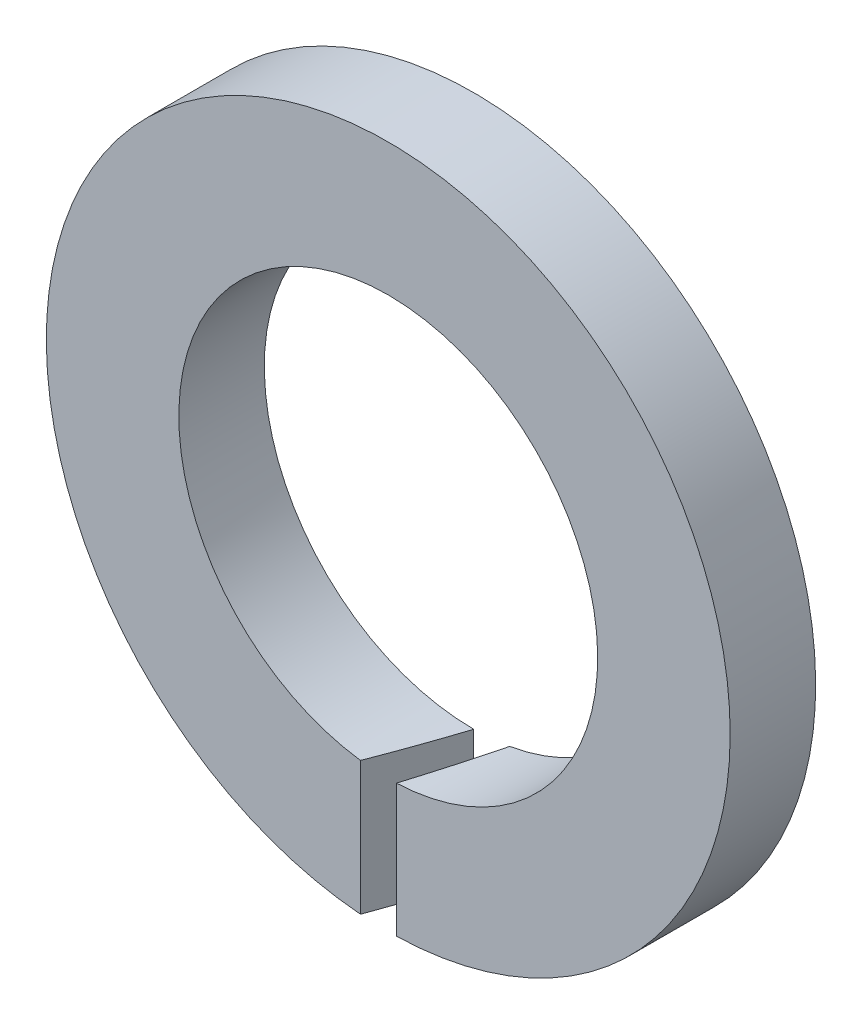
ISO-10303-21;
HEADER;
FILE_DESCRIPTION(('STEP AP214'),'2;1');
FILE_NAME('part.step','',(''),(''),'','','');
FILE_SCHEMA(('AUTOMOTIVE_DESIGN { 1 0 10303 214 1 1 1 1 }'));
ENDSEC;
DATA;
#1=APPLICATION_CONTEXT('core data for automotive mechanical design processes');
#2=APPLICATION_PROTOCOL_DEFINITION('international standard','automotive_design',2000,#1);
#3=PRODUCT_CONTEXT('',#1,'mechanical');
#4=PRODUCT('Part','Part','',(#3));
#5=PRODUCT_RELATED_PRODUCT_CATEGORY('part','',(#4));
#6=PRODUCT_DEFINITION_FORMATION('','',#4);
#7=PRODUCT_DEFINITION_CONTEXT('part definition',#1,'design');
#8=PRODUCT_DEFINITION('design','',#6,#7);
#9=PRODUCT_DEFINITION_SHAPE('','',#8);
#10=(LENGTH_UNIT() NAMED_UNIT(*) SI_UNIT(.MILLI.,.METRE.));
#11=(NAMED_UNIT(*) PLANE_ANGLE_UNIT() SI_UNIT($,.RADIAN.));
#12=(NAMED_UNIT(*) SI_UNIT($,.STERADIAN.) SOLID_ANGLE_UNIT());
#13=UNCERTAINTY_MEASURE_WITH_UNIT(LENGTH_MEASURE(1.E-05),#10,'distance_accuracy_value','');
#14=(GEOMETRIC_REPRESENTATION_CONTEXT(3) GLOBAL_UNCERTAINTY_ASSIGNED_CONTEXT((#13)) GLOBAL_UNIT_ASSIGNED_CONTEXT((#10,
#11,#12)) REPRESENTATION_CONTEXT('',''));
#15=CARTESIAN_POINT('',(0.,0.,0.));
#16=DIRECTION('',(0.,0.,1.));
#17=DIRECTION('',(1.,0.,0.));
#18=AXIS2_PLACEMENT_3D('',#15,#16,#17);
#19=CARTESIAN_POINT('',(0.,0.,5.));
#20=DIRECTION('',(0.,0.,1.));
#21=DIRECTION('',(0.,-1.,0.));
#22=AXIS2_PLACEMENT_3D('',#19,#20,#21);
#23=PLANE('',#22);
#24=DIRECTION('',(0.,-1.,0.));
#25=VECTOR('',#24,1.);
#26=CARTESIAN_POINT('',(-1.62459848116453,0.,5.));
#27=LINE('',#26,#25);
#28=CARTESIAN_POINT('',(-1.62459848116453,-12.141794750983,5.));
#29=VERTEX_POINT('',#28);
#30=CARTESIAN_POINT('',(-1.62459848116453,-19.933907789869,5.));
#31=VERTEX_POINT('',#30);
#32=EDGE_CURVE('E83',#29,#31,#27,.T.);
#33=ORIENTED_EDGE('',*,*,#32,.F.);
#34=CARTESIAN_POINT('',(0.,0.,5.));
#35=DIRECTION('',(0.,0.,1.));
#36=DIRECTION('',(0.,-1.,0.));
#37=AXIS2_PLACEMENT_3D('',#34,#35,#36);
#38=CIRCLE('',#37,12.25);
#39=CARTESIAN_POINT('',(0.478325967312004,-12.240657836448,5.));
#40=VERTEX_POINT('',#39);
#41=EDGE_CURVE('E75',#40,#29,#38,.T.);
#42=ORIENTED_EDGE('',*,*,#41,.F.);
#43=DIRECTION('',(0.,1.,0.));
#44=VECTOR('',#43,1.);
#45=CARTESIAN_POINT('',(0.478325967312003,0.,5.));
#46=LINE('',#45,#44);
#47=CARTESIAN_POINT('',(0.478325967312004,-19.9942792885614,5.));
#48=VERTEX_POINT('',#47);
#49=EDGE_CURVE('E39',#48,#40,#46,.T.);
#50=ORIENTED_EDGE('',*,*,#49,.F.);
#51=CARTESIAN_POINT('',(0.,0.,5.));
#52=DIRECTION('',(0.,0.,-1.));
#53=DIRECTION('',(1.,0.,0.));
#54=AXIS2_PLACEMENT_3D('',#51,#52,#53);
#55=CIRCLE('',#54,20.);
#56=EDGE_CURVE('E63',#31,#48,#55,.T.);
#57=ORIENTED_EDGE('',*,*,#56,.F.);
#58=EDGE_LOOP('',(#33,#42,#50,#57));
#59=FACE_BOUND('',#58,.T.);
#60=ADVANCED_FACE('F16',(#59),#23,.T.);
#61=CARTESIAN_POINT('',(0.,0.,0.));
#62=DIRECTION('',(0.,0.,-1.));
#63=DIRECTION('',(0.,1.,0.));
#64=AXIS2_PLACEMENT_3D('',#61,#62,#63);
#65=PLANE('',#64);
#66=DIRECTION('',(0.,1.,0.));
#67=VECTOR('',#66,1.);
#68=CARTESIAN_POINT('',(0.,0.,0.));
#69=LINE('',#68,#67);
#70=CARTESIAN_POINT('',(0.,-20.,0.));
#71=VERTEX_POINT('',#70);
#72=CARTESIAN_POINT('',(0.,-12.25,0.));
#73=VERTEX_POINT('',#72);
#74=EDGE_CURVE('E32',#71,#73,#69,.T.);
#75=ORIENTED_EDGE('',*,*,#74,.F.);
#76=CARTESIAN_POINT('',(0.,0.,0.));
#77=DIRECTION('',(0.,0.,1.));
#78=DIRECTION('',(1.,0.,0.));
#79=AXIS2_PLACEMENT_3D('',#76,#77,#78);
#80=CIRCLE('',#79,20.);
#81=CARTESIAN_POINT('',(2.10292444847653,-19.8891354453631,0.));
#82=VERTEX_POINT('',#81);
#83=EDGE_CURVE('E70',#82,#71,#80,.T.);
#84=ORIENTED_EDGE('',*,*,#83,.F.);
#85=DIRECTION('',(0.,-1.,0.));
#86=VECTOR('',#85,1.);
#87=CARTESIAN_POINT('',(2.10292444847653,0.,0.));
#88=LINE('',#87,#86);
#89=CARTESIAN_POINT('',(2.10292444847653,-12.0681485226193,0.));
#90=VERTEX_POINT('',#89);
#91=EDGE_CURVE('E56',#90,#82,#88,.T.);
#92=ORIENTED_EDGE('',*,*,#91,.F.);
#93=CARTESIAN_POINT('',(0.,0.,0.));
#94=DIRECTION('',(0.,0.,-1.));
#95=DIRECTION('',(0.,1.,0.));
#96=AXIS2_PLACEMENT_3D('',#93,#94,#95);
#97=CIRCLE('',#96,12.25);
#98=EDGE_CURVE('E68',#73,#90,#97,.T.);
#99=ORIENTED_EDGE('',*,*,#98,.F.);
#100=EDGE_LOOP('',(#75,#84,#92,#99));
#101=FACE_BOUND('',#100,.T.);
#102=ADVANCED_FACE('F67',(#101),#65,.T.);
#103=CARTESIAN_POINT('',(0.,0.,0.));
#104=DIRECTION('',(0.,0.,1.));
#105=DIRECTION('',(1.,0.,0.));
#106=AXIS2_PLACEMENT_3D('',#103,#104,#105);
#107=CYLINDRICAL_SURFACE('',#106,20.);
#108=CARTESIAN_POINT('',(0.,0.,0.));
#109=DIRECTION('',(-0.951056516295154,0.,-0.309016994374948));
#110=DIRECTION('',(-0.309016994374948,0.,0.951056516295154));
#111=AXIS2_PLACEMENT_3D('',#108,#109,#110);
#112=ELLIPSE('',#111,64.7213595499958,20.);
#113=EDGE_CURVE('E76',#31,#71,#112,.F.);
#114=ORIENTED_EDGE('',*,*,#113,.F.);
#115=ORIENTED_EDGE('',*,*,#56,.T.);
#116=CARTESIAN_POINT('',(0.,0.,6.47213595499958));
#117=DIRECTION('',(0.951056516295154,0.,0.309016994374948));
#118=DIRECTION('',(-0.309016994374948,0.,0.951056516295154));
#119=AXIS2_PLACEMENT_3D('',#116,#117,#118);
#120=ELLIPSE('',#119,64.7213595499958,20.);
#121=EDGE_CURVE('E95',#82,#48,#120,.F.);
#122=ORIENTED_EDGE('',*,*,#121,.F.);
#123=ORIENTED_EDGE('',*,*,#83,.T.);
#124=EDGE_LOOP('',(#114,#115,#122,#123));
#125=FACE_BOUND('',#124,.T.);
#126=ADVANCED_FACE('F18',(#125),#107,.T.);
#127=CARTESIAN_POINT('',(0.,0.,-3.));
#128=DIRECTION('',(0.,0.,1.));
#129=DIRECTION('',(1.,0.,0.));
#130=AXIS2_PLACEMENT_3D('',#127,#128,#129);
#131=CYLINDRICAL_SURFACE('',#130,12.25);
#132=ORIENTED_EDGE('',*,*,#41,.T.);
#133=CARTESIAN_POINT('',(0.,0.,0.));
#134=DIRECTION('',(-0.951056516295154,0.,-0.309016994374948));
#135=DIRECTION('',(-0.309016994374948,0.,0.951056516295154));
#136=AXIS2_PLACEMENT_3D('',#133,#134,#135);
#137=ELLIPSE('',#136,39.6418327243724,12.25);
#138=EDGE_CURVE('E11',#29,#73,#137,.F.);
#139=ORIENTED_EDGE('',*,*,#138,.T.);
#140=ORIENTED_EDGE('',*,*,#98,.T.);
#141=CARTESIAN_POINT('',(0.,0.,6.47213595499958));
#142=DIRECTION('',(0.951056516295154,0.,0.309016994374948));
#143=DIRECTION('',(-0.309016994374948,0.,0.951056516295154));
#144=AXIS2_PLACEMENT_3D('',#141,#142,#143);
#145=ELLIPSE('',#144,39.6418327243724,12.25);
#146=EDGE_CURVE('E25',#90,#40,#145,.F.);
#147=ORIENTED_EDGE('',*,*,#146,.T.);
#148=EDGE_LOOP('',(#132,#139,#140,#147));
#149=FACE_BOUND('',#148,.T.);
#150=ADVANCED_FACE('F73',(#149),#131,.F.);
#151=CARTESIAN_POINT('',(3.44719800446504,-20.,-4.13724859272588));
#152=DIRECTION('',(0.951056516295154,0.,0.309016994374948));
#153=DIRECTION('',(-0.309016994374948,0.,0.951056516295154));
#154=AXIS2_PLACEMENT_3D('',#151,#152,#153);
#155=PLANE('',#154);
#156=ORIENTED_EDGE('',*,*,#121,.T.);
#157=ORIENTED_EDGE('',*,*,#49,.T.);
#158=ORIENTED_EDGE('',*,*,#146,.F.);
#159=ORIENTED_EDGE('',*,*,#91,.T.);
#160=EDGE_LOOP('',(#156,#157,#158,#159));
#161=FACE_BOUND('',#160,.T.);
#162=ADVANCED_FACE('F55',(#161),#155,.F.);
#163=CARTESIAN_POINT('',(1.54508497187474,-20.,-4.75528258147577));
#164=DIRECTION('',(-0.951056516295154,0.,-0.309016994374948));
#165=DIRECTION('',(0.309016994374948,0.,-0.951056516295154));
#166=AXIS2_PLACEMENT_3D('',#163,#164,#165);
#167=PLANE('',#166);
#168=ORIENTED_EDGE('',*,*,#113,.T.);
#169=ORIENTED_EDGE('',*,*,#74,.T.);
#170=ORIENTED_EDGE('',*,*,#138,.F.);
#171=ORIENTED_EDGE('',*,*,#32,.T.);
#172=EDGE_LOOP('',(#168,#169,#170,#171));
#173=FACE_BOUND('',#172,.T.);
#174=ADVANCED_FACE('F145',(#173),#167,.F.);
#175=CLOSED_SHELL('',(#60,#102,#126,#150,#162,#174));
#176=MANIFOLD_SOLID_BREP('B1',#175);
#177=ADVANCED_BREP_SHAPE_REPRESENTATION('',(#18,#176),#14);
#178=SHAPE_DEFINITION_REPRESENTATION(#9,#177);
ENDSEC;
END-ISO-10303-21;
